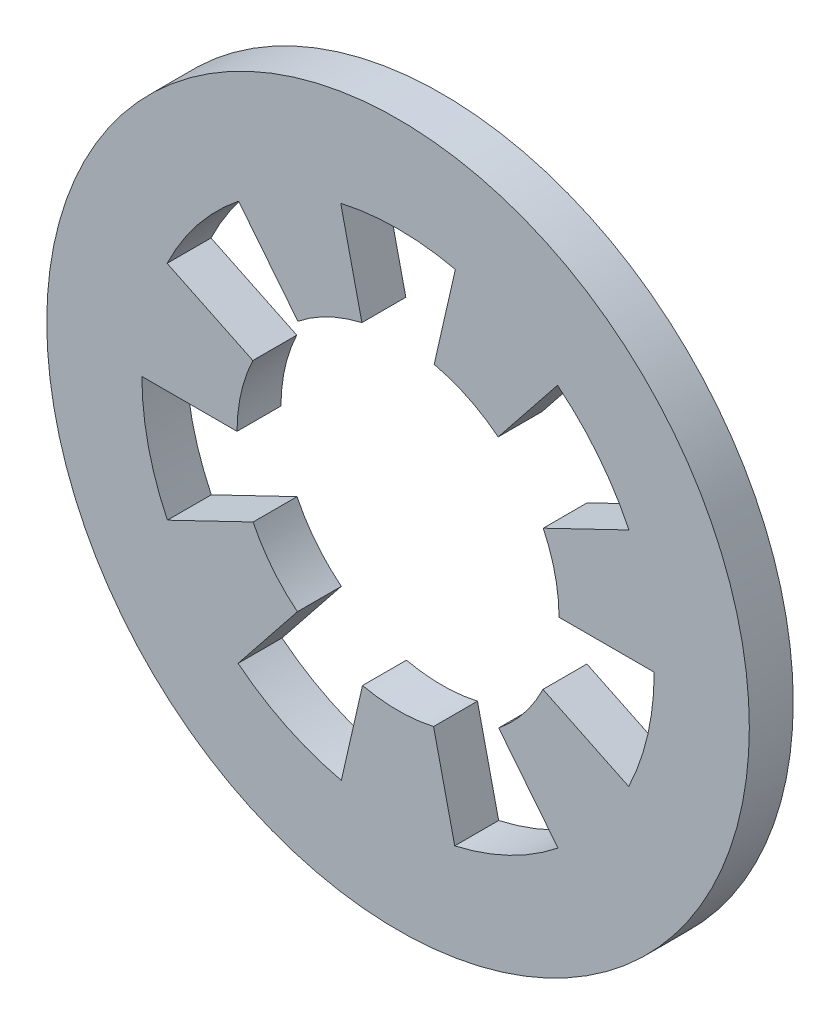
from build123d import *

# Parameters (mm, degrees)
BODYSKE_W      = 1.3
BODYSKE_H      = 0.3
TOOTHCUT_DEPTH = 4.407345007
TOOTHPAT_COUNT = 7


with BuildPart() as part:
    # BodySke → BaseBody (revolve)
    with BuildSketch(Plane(origin=(0, 0, 0), x_dir=(1, 0, 0), z_dir=(0, 1, 0))):
        with Locations((1.75, 0.15)):
            Rectangle(BODYSKE_W, BODYSKE_H)
    revolve(axis=Axis((0, 0, 0), (0, 0, -1)))

    # ToothSke → ToothCut (cut, through all)
    with BuildSketch(Plane.XY):
        with BuildLine():
            Line((-0.391478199, 1.705650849), (-0.246839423, 1.071946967))
            Line((-0.246839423, 1.071946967), (0.246839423, 1.071946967))
            Line((0.246839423, 1.071946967), (0.391478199, 1.705650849))
            ThreePointArc((0.391478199, 1.705650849), (0, 1.75), (-0.391478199, 1.705650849))
        make_face()
    toothcut = extrude(amount=-TOOTHCUT_DEPTH, mode=Mode.SUBTRACT)

    # ToothPat: ToothCut ×7 about axis
    toothpat_axis = Axis((0, 0, 0), (0, 0, 1))
    for i in range(1, TOOTHPAT_COUNT):
        add(toothcut.rotate(toothpat_axis, i * 360 / TOOTHPAT_COUNT), mode=Mode.SUBTRACT)


solid = part.part
